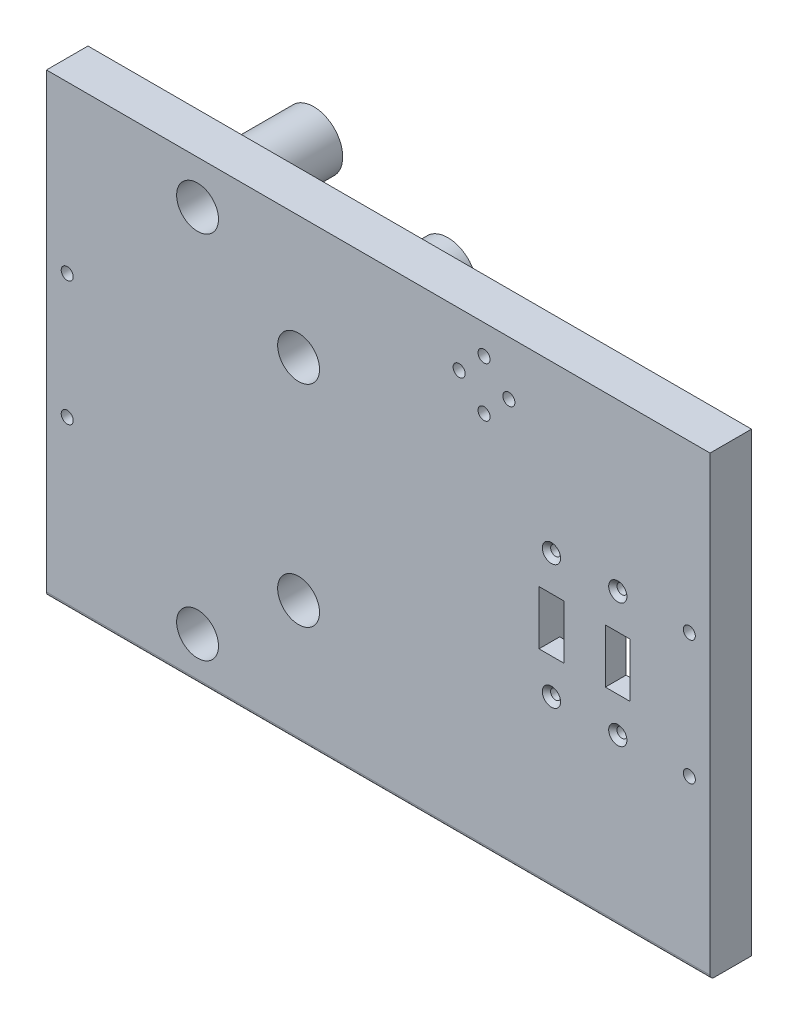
ISO-10303-21;
HEADER;
FILE_DESCRIPTION(('STEP AP214'),'2;1');
FILE_NAME('part.step','',(''),(''),'','','');
FILE_SCHEMA(('AUTOMOTIVE_DESIGN { 1 0 10303 214 1 1 1 1 }'));
ENDSEC;
DATA;
#1=APPLICATION_CONTEXT('core data for automotive mechanical design processes');
#2=APPLICATION_PROTOCOL_DEFINITION('international standard','automotive_design',2000,#1);
#3=PRODUCT_CONTEXT('',#1,'mechanical');
#4=PRODUCT('Part','Part','',(#3));
#5=PRODUCT_RELATED_PRODUCT_CATEGORY('part','',(#4));
#6=PRODUCT_DEFINITION_FORMATION('','',#4);
#7=PRODUCT_DEFINITION_CONTEXT('part definition',#1,'design');
#8=PRODUCT_DEFINITION('design','',#6,#7);
#9=PRODUCT_DEFINITION_SHAPE('','',#8);
#10=(LENGTH_UNIT() NAMED_UNIT(*) SI_UNIT(.MILLI.,.METRE.));
#11=(NAMED_UNIT(*) PLANE_ANGLE_UNIT() SI_UNIT($,.RADIAN.));
#12=(NAMED_UNIT(*) SI_UNIT($,.STERADIAN.) SOLID_ANGLE_UNIT());
#13=UNCERTAINTY_MEASURE_WITH_UNIT(LENGTH_MEASURE(1.E-05),#10,'distance_accuracy_value','');
#14=(GEOMETRIC_REPRESENTATION_CONTEXT(3) GLOBAL_UNCERTAINTY_ASSIGNED_CONTEXT((#13)) GLOBAL_UNIT_ASSIGNED_CONTEXT((#10,
#11,#12)) REPRESENTATION_CONTEXT('',''));
#15=CARTESIAN_POINT('',(0.,0.,0.));
#16=DIRECTION('',(0.,0.,1.));
#17=DIRECTION('',(1.,0.,0.));
#18=AXIS2_PLACEMENT_3D('',#15,#16,#17);
#19=CARTESIAN_POINT('',(0.,0.,0.));
#20=DIRECTION('',(0.,0.,1.));
#21=DIRECTION('',(1.,0.,0.));
#22=AXIS2_PLACEMENT_3D('',#19,#20,#21);
#23=PLANE('',#22);
#24=CARTESIAN_POINT('',(-8.47186139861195,-66.4983642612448,0.));
#25=DIRECTION('',(0.,0.,1.));
#26=DIRECTION('',(1.,0.,0.));
#27=AXIS2_PLACEMENT_3D('',#24,#25,#26);
#28=CIRCLE('',#27,7.);
#29=CARTESIAN_POINT('',(-1.47186139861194,-66.4983642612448,0.));
#30=VERTEX_POINT('',#29);
#31=EDGE_CURVE('E50',#30,#30,#28,.F.);
#32=ORIENTED_EDGE('',*,*,#31,.F.);
#33=EDGE_LOOP('',(#32));
#34=FACE_BOUND('',#33,.T.);
#35=CARTESIAN_POINT('',(-8.47186139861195,-15.7354553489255,0.));
#36=DIRECTION('',(0.,0.,1.));
#37=DIRECTION('',(1.,0.,0.));
#38=AXIS2_PLACEMENT_3D('',#35,#36,#37);
#39=CIRCLE('',#38,7.);
#40=CARTESIAN_POINT('',(-1.47186139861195,-15.7354553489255,0.));
#41=VERTEX_POINT('',#40);
#42=EDGE_CURVE('E266',#41,#41,#39,.F.);
#43=ORIENTED_EDGE('',*,*,#42,.F.);
#44=EDGE_LOOP('',(#43));
#45=FACE_BOUND('',#44,.T.);
#46=CARTESIAN_POINT('',(85.7423896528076,-26.1169098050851,0.));
#47=DIRECTION('',(0.,0.,-1.));
#48=DIRECTION('',(-1.,0.,0.));
#49=AXIS2_PLACEMENT_3D('',#46,#47,#48);
#50=CIRCLE('',#49,1.45);
#51=CARTESIAN_POINT('',(84.2923896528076,-26.1169098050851,0.));
#52=VERTEX_POINT('',#51);
#53=EDGE_CURVE('E343',#52,#52,#50,.T.);
#54=ORIENTED_EDGE('',*,*,#53,.F.);
#55=EDGE_LOOP('',(#54));
#56=FACE_BOUND('',#55,.T.);
#57=CARTESIAN_POINT('',(85.7423896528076,-56.1169098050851,0.));
#58=DIRECTION('',(0.,0.,-1.));
#59=DIRECTION('',(1.,0.,0.));
#60=AXIS2_PLACEMENT_3D('',#57,#58,#59);
#61=CIRCLE('',#60,1.45);
#62=CARTESIAN_POINT('',(87.1923896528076,-56.1169098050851,0.));
#63=VERTEX_POINT('',#62);
#64=EDGE_CURVE('E337',#63,#63,#61,.T.);
#65=ORIENTED_EDGE('',*,*,#64,.F.);
#66=EDGE_LOOP('',(#65));
#67=FACE_BOUND('',#66,.T.);
#68=CARTESIAN_POINT('',(-64.2576103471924,-56.1169098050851,0.));
#69=DIRECTION('',(0.,0.,-1.));
#70=DIRECTION('',(-1.,0.,0.));
#71=AXIS2_PLACEMENT_3D('',#68,#69,#70);
#72=CIRCLE('',#71,1.45);
#73=CARTESIAN_POINT('',(-65.7076103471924,-56.1169098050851,0.));
#74=VERTEX_POINT('',#73);
#75=EDGE_CURVE('E330',#74,#74,#72,.T.);
#76=ORIENTED_EDGE('',*,*,#75,.F.);
#77=EDGE_LOOP('',(#76));
#78=FACE_BOUND('',#77,.T.);
#79=CARTESIAN_POINT('',(-64.2576103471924,-26.1169098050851,0.));
#80=DIRECTION('',(0.,0.,-1.));
#81=DIRECTION('',(1.,0.,0.));
#82=AXIS2_PLACEMENT_3D('',#79,#80,#81);
#83=CIRCLE('',#82,1.45);
#84=CARTESIAN_POINT('',(-62.8076103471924,-26.1169098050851,0.));
#85=VERTEX_POINT('',#84);
#86=EDGE_CURVE('E333',#85,#85,#83,.T.);
#87=ORIENTED_EDGE('',*,*,#86,.F.);
#88=EDGE_LOOP('',(#87));
#89=FACE_BOUND('',#88,.T.);
#90=CARTESIAN_POINT('',(42.2423896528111,0.883090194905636,0.));
#91=DIRECTION('',(0.,0.,-1.));
#92=DIRECTION('',(-1.,0.,0.));
#93=AXIS2_PLACEMENT_3D('',#90,#91,#92);
#94=CIRCLE('',#93,2.75);
#95=CARTESIAN_POINT('',(39.4923896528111,0.883090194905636,0.));
#96=VERTEX_POINT('',#95);
#97=EDGE_CURVE('E351',#96,#96,#94,.T.);
#98=ORIENTED_EDGE('',*,*,#97,.F.);
#99=EDGE_LOOP('',(#98));
#100=FACE_BOUND('',#99,.T.);
#101=CARTESIAN_POINT('',(36.2423896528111,-5.11690980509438,0.));
#102=DIRECTION('',(0.,0.,-1.));
#103=DIRECTION('',(-1.,0.,0.));
#104=AXIS2_PLACEMENT_3D('',#101,#102,#103);
#105=CIRCLE('',#104,2.75);
#106=CARTESIAN_POINT('',(33.4923896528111,-5.11690980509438,0.));
#107=VERTEX_POINT('',#106);
#108=EDGE_CURVE('E362',#107,#107,#105,.T.);
#109=ORIENTED_EDGE('',*,*,#108,.F.);
#110=EDGE_LOOP('',(#109));
#111=FACE_BOUND('',#110,.T.);
#112=CARTESIAN_POINT('',(30.2423896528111,0.883090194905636,0.));
#113=DIRECTION('',(0.,0.,-1.));
#114=DIRECTION('',(-1.,0.,0.));
#115=AXIS2_PLACEMENT_3D('',#112,#113,#114);
#116=CIRCLE('',#115,2.75);
#117=CARTESIAN_POINT('',(27.4923896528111,0.883090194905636,0.));
#118=VERTEX_POINT('',#117);
#119=EDGE_CURVE('E371',#118,#118,#116,.T.);
#120=ORIENTED_EDGE('',*,*,#119,.F.);
#121=EDGE_LOOP('',(#120));
#122=FACE_BOUND('',#121,.T.);
#123=CARTESIAN_POINT('',(36.2423896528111,6.88309019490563,0.));
#124=DIRECTION('',(0.,0.,-1.));
#125=DIRECTION('',(-1.,0.,0.));
#126=AXIS2_PLACEMENT_3D('',#123,#124,#125);
#127=CIRCLE('',#126,2.75);
#128=CARTESIAN_POINT('',(33.4923896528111,6.88309019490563,0.));
#129=VERTEX_POINT('',#128);
#130=EDGE_CURVE('E380',#129,#129,#127,.T.);
#131=ORIENTED_EDGE('',*,*,#130,.F.);
#132=EDGE_LOOP('',(#131));
#133=FACE_BOUND('',#132,.T.);
#134=DIRECTION('',(-1.,0.,0.));
#135=VECTOR('',#134,1.);
#136=CARTESIAN_POINT('',(71.4981129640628,-58.6169098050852,0.));
#137=LINE('',#136,#135);
#138=CARTESIAN_POINT('',(71.4981129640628,-58.6169098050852,0.));
#139=VERTEX_POINT('',#138);
#140=CARTESIAN_POINT('',(49.4981129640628,-58.6169098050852,0.));
#141=VERTEX_POINT('',#140);
#142=EDGE_CURVE('E200',#139,#141,#137,.T.);
#143=ORIENTED_EDGE('',*,*,#142,.F.);
#144=DIRECTION('',(0.,-1.,0.));
#145=VECTOR('',#144,1.);
#146=CARTESIAN_POINT('',(71.4981129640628,-23.6169098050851,0.));
#147=LINE('',#146,#145);
#148=CARTESIAN_POINT('',(71.4981129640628,-23.6169098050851,0.));
#149=VERTEX_POINT('',#148);
#150=EDGE_CURVE('E198',#149,#139,#147,.T.);
#151=ORIENTED_EDGE('',*,*,#150,.F.);
#152=DIRECTION('',(1.,0.,0.));
#153=VECTOR('',#152,1.);
#154=CARTESIAN_POINT('',(71.4981129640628,-23.6169098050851,0.));
#155=LINE('',#154,#153);
#156=CARTESIAN_POINT('',(49.4981129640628,-23.6169098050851,0.));
#157=VERTEX_POINT('',#156);
#158=EDGE_CURVE('E206',#157,#149,#155,.T.);
#159=ORIENTED_EDGE('',*,*,#158,.F.);
#160=DIRECTION('',(0.,1.,0.));
#161=VECTOR('',#160,1.);
#162=CARTESIAN_POINT('',(49.4981129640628,-23.6169098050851,0.));
#163=LINE('',#162,#161);
#164=EDGE_CURVE('E204',#141,#157,#163,.T.);
#165=ORIENTED_EDGE('',*,*,#164,.F.);
#166=EDGE_LOOP('',(#143,#151,#159,#165));
#167=FACE_BOUND('',#166,.T.);
#168=DIRECTION('',(0.,-1.,0.));
#169=VECTOR('',#168,1.);
#170=CARTESIAN_POINT('',(-69.2576103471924,13.8830901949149,0.));
#171=LINE('',#170,#169);
#172=CARTESIAN_POINT('',(-69.2576103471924,13.8830901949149,0.));
#173=VERTEX_POINT('',#172);
#174=CARTESIAN_POINT('',(-69.2576103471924,-96.1169098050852,0.));
#175=VERTEX_POINT('',#174);
#176=EDGE_CURVE('E222',#173,#175,#171,.T.);
#177=ORIENTED_EDGE('',*,*,#176,.F.);
#178=DIRECTION('',(-1.,0.,0.));
#179=VECTOR('',#178,1.);
#180=CARTESIAN_POINT('',(-69.2576103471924,13.8830901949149,0.));
#181=LINE('',#180,#179);
#182=CARTESIAN_POINT('',(90.7423896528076,13.8830901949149,0.));
#183=VERTEX_POINT('',#182);
#184=EDGE_CURVE('E235',#183,#173,#181,.T.);
#185=ORIENTED_EDGE('',*,*,#184,.F.);
#186=DIRECTION('',(0.,1.,0.));
#187=VECTOR('',#186,1.);
#188=CARTESIAN_POINT('',(90.7423896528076,13.8830901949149,0.));
#189=LINE('',#188,#187);
#190=CARTESIAN_POINT('',(90.7423896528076,-96.1169098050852,0.));
#191=VERTEX_POINT('',#190);
#192=EDGE_CURVE('E245',#191,#183,#189,.T.);
#193=ORIENTED_EDGE('',*,*,#192,.F.);
#194=DIRECTION('',(1.,0.,0.));
#195=VECTOR('',#194,1.);
#196=CARTESIAN_POINT('',(-69.2576103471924,-96.1169098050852,0.));
#197=LINE('',#196,#195);
#198=EDGE_CURVE('E242',#175,#191,#197,.T.);
#199=ORIENTED_EDGE('',*,*,#198,.F.);
#200=EDGE_LOOP('',(#177,#185,#193,#199));
#201=FACE_BOUND('',#200,.T.);
#202=CARTESIAN_POINT('',(-32.8300788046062,3.43945651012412,0.));
#203=DIRECTION('',(0.,0.,1.));
#204=DIRECTION('',(1.,0.,0.));
#205=AXIS2_PLACEMENT_3D('',#202,#203,#204);
#206=CIRCLE('',#205,7.);
#207=CARTESIAN_POINT('',(-25.8300788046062,3.43945651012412,0.));
#208=VERTEX_POINT('',#207);
#209=EDGE_CURVE('E269',#208,#208,#206,.F.);
#210=ORIENTED_EDGE('',*,*,#209,.F.);
#211=EDGE_LOOP('',(#210));
#212=FACE_BOUND('',#211,.T.);
#213=CARTESIAN_POINT('',(-32.8300788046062,-85.6732761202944,0.));
#214=DIRECTION('',(0.,0.,1.));
#215=DIRECTION('',(1.,0.,0.));
#216=AXIS2_PLACEMENT_3D('',#213,#214,#215);
#217=CIRCLE('',#216,7.);
#218=CARTESIAN_POINT('',(-25.8300788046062,-85.6732761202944,0.));
#219=VERTEX_POINT('',#218);
#220=EDGE_CURVE('E11',#219,#219,#217,.F.);
#221=ORIENTED_EDGE('',*,*,#220,.F.);
#222=EDGE_LOOP('',(#221));
#223=FACE_BOUND('',#222,.T.);
#224=ADVANCED_FACE('F41',(#34,#45,#56,#67,#78,#89,#100,#111,#122,#133,#167,#201,#212,#223),#23,.F.);
#225=CARTESIAN_POINT('',(0.,0.,10.));
#226=DIRECTION('',(0.,0.,1.));
#227=DIRECTION('',(1.,0.,0.));
#228=AXIS2_PLACEMENT_3D('',#225,#226,#227);
#229=PLANE('',#228);
#230=CARTESIAN_POINT('',(52.4981129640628,-26.1169098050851,10.));
#231=DIRECTION('',(0.,0.,1.));
#232=DIRECTION('',(1.,0.,0.));
#233=AXIS2_PLACEMENT_3D('',#230,#231,#232);
#234=CIRCLE('',#233,2.2);
#235=CARTESIAN_POINT('',(54.6981129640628,-26.1169098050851,10.));
#236=VERTEX_POINT('',#235);
#237=EDGE_CURVE('E870',#236,#236,#234,.T.);
#238=ORIENTED_EDGE('',*,*,#237,.F.);
#239=EDGE_LOOP('',(#238));
#240=FACE_BOUND('',#239,.T.);
#241=CARTESIAN_POINT('',(68.4981129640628,-26.1169098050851,10.));
#242=DIRECTION('',(0.,0.,1.));
#243=DIRECTION('',(1.,0.,0.));
#244=AXIS2_PLACEMENT_3D('',#241,#242,#243);
#245=CIRCLE('',#244,2.20000000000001);
#246=CARTESIAN_POINT('',(70.6981129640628,-26.1169098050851,10.));
#247=VERTEX_POINT('',#246);
#248=EDGE_CURVE('E292',#247,#247,#245,.T.);
#249=ORIENTED_EDGE('',*,*,#248,.F.);
#250=EDGE_LOOP('',(#249));
#251=FACE_BOUND('',#250,.T.);
#252=CARTESIAN_POINT('',(52.4981129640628,-56.1169098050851,10.));
#253=DIRECTION('',(0.,0.,1.));
#254=DIRECTION('',(1.,0.,0.));
#255=AXIS2_PLACEMENT_3D('',#252,#253,#254);
#256=CIRCLE('',#255,2.2);
#257=CARTESIAN_POINT('',(54.6981129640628,-56.1169098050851,10.));
#258=VERTEX_POINT('',#257);
#259=EDGE_CURVE('E285',#258,#258,#256,.T.);
#260=ORIENTED_EDGE('',*,*,#259,.F.);
#261=EDGE_LOOP('',(#260));
#262=FACE_BOUND('',#261,.T.);
#263=CARTESIAN_POINT('',(68.4981129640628,-56.1169098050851,10.));
#264=DIRECTION('',(0.,0.,1.));
#265=DIRECTION('',(1.,0.,0.));
#266=AXIS2_PLACEMENT_3D('',#263,#264,#265);
#267=CIRCLE('',#266,2.19999999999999);
#268=CARTESIAN_POINT('',(70.6981129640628,-56.1169098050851,10.));
#269=VERTEX_POINT('',#268);
#270=EDGE_CURVE('E281',#269,#269,#267,.T.);
#271=ORIENTED_EDGE('',*,*,#270,.F.);
#272=EDGE_LOOP('',(#271));
#273=FACE_BOUND('',#272,.T.);
#274=CARTESIAN_POINT('',(85.7423896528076,-26.1169098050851,10.));
#275=DIRECTION('',(0.,0.,-1.));
#276=DIRECTION('',(-1.,0.,0.));
#277=AXIS2_PLACEMENT_3D('',#274,#275,#276);
#278=CIRCLE('',#277,1.45);
#279=CARTESIAN_POINT('',(84.2923896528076,-26.1169098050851,10.));
#280=VERTEX_POINT('',#279);
#281=EDGE_CURVE('E329',#280,#280,#278,.T.);
#282=ORIENTED_EDGE('',*,*,#281,.T.);
#283=EDGE_LOOP('',(#282));
#284=FACE_BOUND('',#283,.T.);
#285=CARTESIAN_POINT('',(85.7423896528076,-56.1169098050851,10.));
#286=DIRECTION('',(0.,0.,-1.));
#287=DIRECTION('',(1.,0.,0.));
#288=AXIS2_PLACEMENT_3D('',#285,#286,#287);
#289=CIRCLE('',#288,1.45);
#290=CARTESIAN_POINT('',(87.1923896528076,-56.1169098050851,10.));
#291=VERTEX_POINT('',#290);
#292=EDGE_CURVE('E340',#291,#291,#289,.T.);
#293=ORIENTED_EDGE('',*,*,#292,.T.);
#294=EDGE_LOOP('',(#293));
#295=FACE_BOUND('',#294,.T.);
#296=CARTESIAN_POINT('',(-64.2576103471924,-56.1169098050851,10.));
#297=DIRECTION('',(0.,0.,-1.));
#298=DIRECTION('',(-1.,0.,0.));
#299=AXIS2_PLACEMENT_3D('',#296,#297,#298);
#300=CIRCLE('',#299,1.45);
#301=CARTESIAN_POINT('',(-65.7076103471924,-56.1169098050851,10.));
#302=VERTEX_POINT('',#301);
#303=EDGE_CURVE('E334',#302,#302,#300,.T.);
#304=ORIENTED_EDGE('',*,*,#303,.T.);
#305=EDGE_LOOP('',(#304));
#306=FACE_BOUND('',#305,.T.);
#307=CARTESIAN_POINT('',(-64.2576103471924,-26.1169098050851,10.));
#308=DIRECTION('',(0.,0.,-1.));
#309=DIRECTION('',(1.,0.,0.));
#310=AXIS2_PLACEMENT_3D('',#307,#308,#309);
#311=CIRCLE('',#310,1.45);
#312=CARTESIAN_POINT('',(-62.8076103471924,-26.1169098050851,10.));
#313=VERTEX_POINT('',#312);
#314=EDGE_CURVE('E348',#313,#313,#311,.T.);
#315=ORIENTED_EDGE('',*,*,#314,.T.);
#316=EDGE_LOOP('',(#315));
#317=FACE_BOUND('',#316,.T.);
#318=CARTESIAN_POINT('',(42.2423896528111,0.883090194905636,10.));
#319=DIRECTION('',(0.,0.,-1.));
#320=DIRECTION('',(-1.,0.,0.));
#321=AXIS2_PLACEMENT_3D('',#318,#319,#320);
#322=CIRCLE('',#321,1.45);
#323=CARTESIAN_POINT('',(40.7923896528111,0.883090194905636,10.));
#324=VERTEX_POINT('',#323);
#325=EDGE_CURVE('E359',#324,#324,#322,.T.);
#326=ORIENTED_EDGE('',*,*,#325,.T.);
#327=EDGE_LOOP('',(#326));
#328=FACE_BOUND('',#327,.T.);
#329=CARTESIAN_POINT('',(36.2423896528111,6.88309019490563,10.));
#330=DIRECTION('',(0.,0.,-1.));
#331=DIRECTION('',(-1.,0.,0.));
#332=AXIS2_PLACEMENT_3D('',#329,#330,#331);
#333=CIRCLE('',#332,1.45);
#334=CARTESIAN_POINT('',(34.7923896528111,6.88309019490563,10.));
#335=VERTEX_POINT('',#334);
#336=EDGE_CURVE('E175',#335,#335,#333,.T.);
#337=ORIENTED_EDGE('',*,*,#336,.T.);
#338=EDGE_LOOP('',(#337));
#339=FACE_BOUND('',#338,.T.);
#340=DIRECTION('',(0.,1.,0.));
#341=VECTOR('',#340,1.);
#342=CARTESIAN_POINT('',(49.4981129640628,-34.6169098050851,10.));
#343=LINE('',#342,#341);
#344=CARTESIAN_POINT('',(49.4981129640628,-47.6169098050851,10.));
#345=VERTEX_POINT('',#344);
#346=CARTESIAN_POINT('',(49.4981129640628,-34.6169098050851,10.));
#347=VERTEX_POINT('',#346);
#348=EDGE_CURVE('E170',#345,#347,#343,.T.);
#349=ORIENTED_EDGE('',*,*,#348,.T.);
#350=DIRECTION('',(1.,0.,0.));
#351=VECTOR('',#350,1.);
#352=CARTESIAN_POINT('',(49.4981129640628,-34.6169098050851,10.));
#353=LINE('',#352,#351);
#354=CARTESIAN_POINT('',(55.4981129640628,-34.6169098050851,10.));
#355=VERTEX_POINT('',#354);
#356=EDGE_CURVE('E401',#347,#355,#353,.T.);
#357=ORIENTED_EDGE('',*,*,#356,.T.);
#358=DIRECTION('',(0.,-1.,0.));
#359=VECTOR('',#358,1.);
#360=CARTESIAN_POINT('',(55.4981129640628,-34.6169098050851,10.));
#361=LINE('',#360,#359);
#362=CARTESIAN_POINT('',(55.4981129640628,-47.6169098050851,10.));
#363=VERTEX_POINT('',#362);
#364=EDGE_CURVE('E58',#355,#363,#361,.T.);
#365=ORIENTED_EDGE('',*,*,#364,.T.);
#366=DIRECTION('',(-1.,0.,0.));
#367=VECTOR('',#366,1.);
#368=CARTESIAN_POINT('',(49.4981129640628,-47.6169098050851,10.));
#369=LINE('',#368,#367);
#370=EDGE_CURVE('E390',#363,#345,#369,.T.);
#371=ORIENTED_EDGE('',*,*,#370,.T.);
#372=EDGE_LOOP('',(#349,#357,#365,#371));
#373=FACE_BOUND('',#372,.T.);
#374=DIRECTION('',(1.,0.,0.));
#375=VECTOR('',#374,1.);
#376=CARTESIAN_POINT('',(71.4981129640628,-34.6169098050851,10.));
#377=LINE('',#376,#375);
#378=CARTESIAN_POINT('',(65.4981129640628,-34.6169098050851,10.));
#379=VERTEX_POINT('',#378);
#380=CARTESIAN_POINT('',(71.4981129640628,-34.6169098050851,10.));
#381=VERTEX_POINT('',#380);
#382=EDGE_CURVE('E405',#379,#381,#377,.T.);
#383=ORIENTED_EDGE('',*,*,#382,.T.);
#384=DIRECTION('',(0.,-1.,0.));
#385=VECTOR('',#384,1.);
#386=CARTESIAN_POINT('',(71.4981129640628,-34.6169098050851,10.));
#387=LINE('',#386,#385);
#388=CARTESIAN_POINT('',(71.4981129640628,-47.6169098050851,10.));
#389=VERTEX_POINT('',#388);
#390=EDGE_CURVE('E408',#381,#389,#387,.T.);
#391=ORIENTED_EDGE('',*,*,#390,.T.);
#392=DIRECTION('',(-1.,0.,0.));
#393=VECTOR('',#392,1.);
#394=CARTESIAN_POINT('',(71.4981129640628,-47.6169098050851,10.));
#395=LINE('',#394,#393);
#396=CARTESIAN_POINT('',(65.4981129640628,-47.6169098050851,10.));
#397=VERTEX_POINT('',#396);
#398=EDGE_CURVE('E66',#389,#397,#395,.T.);
#399=ORIENTED_EDGE('',*,*,#398,.T.);
#400=DIRECTION('',(0.,1.,0.));
#401=VECTOR('',#400,1.);
#402=CARTESIAN_POINT('',(65.4981129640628,-34.6169098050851,10.));
#403=LINE('',#402,#401);
#404=EDGE_CURVE('E413',#397,#379,#403,.T.);
#405=ORIENTED_EDGE('',*,*,#404,.T.);
#406=EDGE_LOOP('',(#383,#391,#399,#405));
#407=FACE_BOUND('',#406,.T.);
#408=CARTESIAN_POINT('',(-32.8300788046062,3.43945651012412,10.));
#409=DIRECTION('',(0.,0.,1.));
#410=DIRECTION('',(1.,0.,0.));
#411=AXIS2_PLACEMENT_3D('',#408,#409,#410);
#412=CIRCLE('',#411,5.05);
#413=CARTESIAN_POINT('',(-27.7800788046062,3.43945651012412,10.));
#414=VERTEX_POINT('',#413);
#415=EDGE_CURVE('E219',#414,#414,#412,.T.);
#416=ORIENTED_EDGE('',*,*,#415,.F.);
#417=EDGE_LOOP('',(#416));
#418=FACE_BOUND('',#417,.T.);
#419=CARTESIAN_POINT('',(-32.8300788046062,-85.6732761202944,10.));
#420=DIRECTION('',(0.,0.,1.));
#421=DIRECTION('',(-1.,0.,0.));
#422=AXIS2_PLACEMENT_3D('',#419,#420,#421);
#423=CIRCLE('',#422,5.05);
#424=CARTESIAN_POINT('',(-37.8800788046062,-85.6732761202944,10.));
#425=VERTEX_POINT('',#424);
#426=EDGE_CURVE('E223',#425,#425,#423,.T.);
#427=ORIENTED_EDGE('',*,*,#426,.F.);
#428=EDGE_LOOP('',(#427));
#429=FACE_BOUND('',#428,.T.);
#430=CARTESIAN_POINT('',(-8.47186139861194,-66.4983642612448,10.));
#431=DIRECTION('',(0.,0.,1.));
#432=DIRECTION('',(-1.,0.,0.));
#433=AXIS2_PLACEMENT_3D('',#430,#431,#432);
#434=CIRCLE('',#433,5.05);
#435=CARTESIAN_POINT('',(-13.5218613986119,-66.4983642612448,10.));
#436=VERTEX_POINT('',#435);
#437=EDGE_CURVE('E226',#436,#436,#434,.T.);
#438=ORIENTED_EDGE('',*,*,#437,.F.);
#439=EDGE_LOOP('',(#438));
#440=FACE_BOUND('',#439,.T.);
#441=CARTESIAN_POINT('',(-8.47186139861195,-15.7354553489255,10.));
#442=DIRECTION('',(0.,0.,1.));
#443=DIRECTION('',(1.,0.,0.));
#444=AXIS2_PLACEMENT_3D('',#441,#442,#443);
#445=CIRCLE('',#444,5.05);
#446=CARTESIAN_POINT('',(-3.42186139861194,-15.7354553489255,10.));
#447=VERTEX_POINT('',#446);
#448=EDGE_CURVE('E212',#447,#447,#445,.T.);
#449=ORIENTED_EDGE('',*,*,#448,.F.);
#450=EDGE_LOOP('',(#449));
#451=FACE_BOUND('',#450,.T.);
#452=DIRECTION('',(0.,-1.,0.));
#453=VECTOR('',#452,1.);
#454=CARTESIAN_POINT('',(-69.2576103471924,13.8830901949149,10.));
#455=LINE('',#454,#453);
#456=CARTESIAN_POINT('',(-69.2576103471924,13.8830901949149,10.));
#457=VERTEX_POINT('',#456);
#458=CARTESIAN_POINT('',(-69.2576103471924,-95.1169098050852,10.));
#459=VERTEX_POINT('',#458);
#460=EDGE_CURVE('E231',#457,#459,#455,.T.);
#461=ORIENTED_EDGE('',*,*,#460,.T.);
#462=DIRECTION('',(1.,0.,0.));
#463=VECTOR('',#462,1.);
#464=CARTESIAN_POINT('',(90.7423896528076,-95.1169098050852,10.));
#465=LINE('',#464,#463);
#466=CARTESIAN_POINT('',(90.7423896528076,-95.1169098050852,10.));
#467=VERTEX_POINT('',#466);
#468=EDGE_CURVE('E257',#459,#467,#465,.T.);
#469=ORIENTED_EDGE('',*,*,#468,.T.);
#470=DIRECTION('',(0.,1.,0.));
#471=VECTOR('',#470,1.);
#472=CARTESIAN_POINT('',(90.7423896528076,13.8830901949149,10.));
#473=LINE('',#472,#471);
#474=CARTESIAN_POINT('',(90.7423896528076,13.8830901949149,10.));
#475=VERTEX_POINT('',#474);
#476=EDGE_CURVE('E234',#467,#475,#473,.T.);
#477=ORIENTED_EDGE('',*,*,#476,.T.);
#478=DIRECTION('',(-1.,0.,0.));
#479=VECTOR('',#478,1.);
#480=CARTESIAN_POINT('',(-69.2576103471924,13.8830901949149,10.));
#481=LINE('',#480,#479);
#482=EDGE_CURVE('E237',#475,#457,#481,.T.);
#483=ORIENTED_EDGE('',*,*,#482,.T.);
#484=EDGE_LOOP('',(#461,#469,#477,#483));
#485=FACE_BOUND('',#484,.T.);
#486=CARTESIAN_POINT('',(30.2423896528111,0.883090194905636,10.));
#487=DIRECTION('',(0.,0.,-1.));
#488=DIRECTION('',(-1.,0.,0.));
#489=AXIS2_PLACEMENT_3D('',#486,#487,#488);
#490=CIRCLE('',#489,1.45);
#491=CARTESIAN_POINT('',(28.7923896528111,0.883090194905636,10.));
#492=VERTEX_POINT('',#491);
#493=EDGE_CURVE('E377',#492,#492,#490,.T.);
#494=ORIENTED_EDGE('',*,*,#493,.T.);
#495=EDGE_LOOP('',(#494));
#496=FACE_BOUND('',#495,.T.);
#497=CARTESIAN_POINT('',(36.2423896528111,-5.11690980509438,10.));
#498=DIRECTION('',(0.,0.,-1.));
#499=DIRECTION('',(-1.,0.,0.));
#500=AXIS2_PLACEMENT_3D('',#497,#498,#499);
#501=CIRCLE('',#500,1.45);
#502=CARTESIAN_POINT('',(34.7923896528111,-5.11690980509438,10.));
#503=VERTEX_POINT('',#502);
#504=EDGE_CURVE('E368',#503,#503,#501,.T.);
#505=ORIENTED_EDGE('',*,*,#504,.T.);
#506=EDGE_LOOP('',(#505));
#507=FACE_BOUND('',#506,.T.);
#508=ADVANCED_FACE('F456',(#240,#251,#262,#273,#284,#295,#306,#317,#328,#339,#373,#407,#418,
#429,#440,#451,#485,#496,#507),#229,.T.);
#509=CARTESIAN_POINT('',(-69.2576103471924,13.8830901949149,10.));
#510=DIRECTION('',(1.,0.,0.));
#511=DIRECTION('',(0.,1.,0.));
#512=AXIS2_PLACEMENT_3D('',#509,#510,#511);
#513=PLANE('',#512);
#514=DIRECTION('',(0.,0.,-1.));
#515=VECTOR('',#514,1.);
#516=CARTESIAN_POINT('',(-69.2576103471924,-96.1169098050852,10.));
#517=LINE('',#516,#515);
#518=CARTESIAN_POINT('',(-69.2576103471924,-96.1169098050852,9.));
#519=VERTEX_POINT('',#518);
#520=EDGE_CURVE('E255',#519,#175,#517,.T.);
#521=ORIENTED_EDGE('',*,*,#520,.F.);
#522=CARTESIAN_POINT('',(-69.2576103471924,-95.1169098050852,9.));
#523=DIRECTION('',(1.,0.,0.));
#524=DIRECTION('',(0.,1.,0.));
#525=AXIS2_PLACEMENT_3D('',#522,#523,#524);
#526=CIRCLE('',#525,1.);
#527=EDGE_CURVE('E264',#519,#459,#526,.F.);
#528=ORIENTED_EDGE('',*,*,#527,.T.);
#529=ORIENTED_EDGE('',*,*,#460,.F.);
#530=DIRECTION('',(0.,0.,-1.));
#531=VECTOR('',#530,1.);
#532=CARTESIAN_POINT('',(-69.2576103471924,13.8830901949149,10.));
#533=LINE('',#532,#531);
#534=EDGE_CURVE('E239',#457,#173,#533,.T.);
#535=ORIENTED_EDGE('',*,*,#534,.T.);
#536=ORIENTED_EDGE('',*,*,#176,.T.);
#537=EDGE_LOOP('',(#521,#528,#529,#535,#536));
#538=FACE_BOUND('',#537,.T.);
#539=ADVANCED_FACE('F459',(#538),#513,.F.);
#540=CARTESIAN_POINT('',(-69.2576103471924,-96.1169098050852,10.));
#541=DIRECTION('',(0.,1.,0.));
#542=DIRECTION('',(0.,0.,1.));
#543=AXIS2_PLACEMENT_3D('',#540,#541,#542);
#544=PLANE('',#543);
#545=DIRECTION('',(0.,0.,-1.));
#546=VECTOR('',#545,1.);
#547=CARTESIAN_POINT('',(90.7423896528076,-96.1169098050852,10.));
#548=LINE('',#547,#546);
#549=CARTESIAN_POINT('',(90.7423896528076,-96.1169098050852,9.));
#550=VERTEX_POINT('',#549);
#551=EDGE_CURVE('E253',#550,#191,#548,.T.);
#552=ORIENTED_EDGE('',*,*,#551,.F.);
#553=DIRECTION('',(1.,0.,0.));
#554=VECTOR('',#553,1.);
#555=CARTESIAN_POINT('',(-69.2576103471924,-96.1169098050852,9.));
#556=LINE('',#555,#554);
#557=EDGE_CURVE('E262',#550,#519,#556,.F.);
#558=ORIENTED_EDGE('',*,*,#557,.T.);
#559=ORIENTED_EDGE('',*,*,#520,.T.);
#560=ORIENTED_EDGE('',*,*,#198,.T.);
#561=EDGE_LOOP('',(#552,#558,#559,#560));
#562=FACE_BOUND('',#561,.T.);
#563=ADVANCED_FACE('F570',(#562),#544,.F.);
#564=CARTESIAN_POINT('',(90.7423896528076,13.8830901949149,10.));
#565=DIRECTION('',(-1.,0.,0.));
#566=DIRECTION('',(0.,0.,1.));
#567=AXIS2_PLACEMENT_3D('',#564,#565,#566);
#568=PLANE('',#567);
#569=ORIENTED_EDGE('',*,*,#476,.F.);
#570=CARTESIAN_POINT('',(90.7423896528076,-95.1169098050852,9.));
#571=DIRECTION('',(-1.,0.,0.));
#572=DIRECTION('',(0.,0.,1.));
#573=AXIS2_PLACEMENT_3D('',#570,#571,#572);
#574=CIRCLE('',#573,1.);
#575=EDGE_CURVE('E260',#467,#550,#574,.F.);
#576=ORIENTED_EDGE('',*,*,#575,.T.);
#577=ORIENTED_EDGE('',*,*,#551,.T.);
#578=ORIENTED_EDGE('',*,*,#192,.T.);
#579=DIRECTION('',(0.,0.,-1.));
#580=VECTOR('',#579,1.);
#581=CARTESIAN_POINT('',(90.7423896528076,13.8830901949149,10.));
#582=LINE('',#581,#580);
#583=EDGE_CURVE('E250',#475,#183,#582,.T.);
#584=ORIENTED_EDGE('',*,*,#583,.F.);
#585=EDGE_LOOP('',(#569,#576,#577,#578,#584));
#586=FACE_BOUND('',#585,.T.);
#587=ADVANCED_FACE('F566',(#586),#568,.F.);
#588=CARTESIAN_POINT('',(-69.2576103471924,13.8830901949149,10.));
#589=DIRECTION('',(0.,-1.,0.));
#590=DIRECTION('',(0.,0.,-1.));
#591=AXIS2_PLACEMENT_3D('',#588,#589,#590);
#592=PLANE('',#591);
#593=ORIENTED_EDGE('',*,*,#184,.T.);
#594=ORIENTED_EDGE('',*,*,#534,.F.);
#595=ORIENTED_EDGE('',*,*,#482,.F.);
#596=ORIENTED_EDGE('',*,*,#583,.T.);
#597=EDGE_LOOP('',(#593,#594,#595,#596));
#598=FACE_BOUND('',#597,.T.);
#599=ADVANCED_FACE('F561',(#598),#592,.F.);
#600=CARTESIAN_POINT('',(-8.47186139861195,-15.7354553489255,0.));
#601=DIRECTION('',(0.,0.,1.));
#602=DIRECTION('',(1.,0.,0.));
#603=AXIS2_PLACEMENT_3D('',#600,#601,#602);
#604=CYLINDRICAL_SURFACE('',#603,5.05);
#605=ORIENTED_EDGE('',*,*,#448,.T.);
#606=EDGE_LOOP('',(#605));
#607=FACE_BOUND('',#606,.T.);
#608=CARTESIAN_POINT('',(-8.47186139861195,-15.7354553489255,-26.));
#609=DIRECTION('',(0.,0.,-1.));
#610=DIRECTION('',(-1.,0.,0.));
#611=AXIS2_PLACEMENT_3D('',#608,#609,#610);
#612=CIRCLE('',#611,5.05000000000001);
#613=CARTESIAN_POINT('',(-13.521861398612,-15.7354553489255,-26.));
#614=VERTEX_POINT('',#613);
#615=EDGE_CURVE('E311',#614,#614,#612,.T.);
#616=ORIENTED_EDGE('',*,*,#615,.T.);
#617=EDGE_LOOP('',(#616));
#618=FACE_BOUND('',#617,.T.);
#619=ADVANCED_FACE('F558',(#607,#618),#604,.F.);
#620=CARTESIAN_POINT('',(-8.47186139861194,-66.4983642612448,0.));
#621=DIRECTION('',(0.,0.,1.));
#622=DIRECTION('',(1.,0.,0.));
#623=AXIS2_PLACEMENT_3D('',#620,#621,#622);
#624=CYLINDRICAL_SURFACE('',#623,5.05);
#625=ORIENTED_EDGE('',*,*,#437,.T.);
#626=EDGE_LOOP('',(#625));
#627=FACE_BOUND('',#626,.T.);
#628=CARTESIAN_POINT('',(-8.47186139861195,-66.4983642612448,-26.));
#629=DIRECTION('',(0.,0.,-1.));
#630=DIRECTION('',(1.,0.,0.));
#631=AXIS2_PLACEMENT_3D('',#628,#629,#630);
#632=CIRCLE('',#631,5.05);
#633=CARTESIAN_POINT('',(-3.42186139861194,-66.4983642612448,-26.));
#634=VERTEX_POINT('',#633);
#635=EDGE_CURVE('E308',#634,#634,#632,.T.);
#636=ORIENTED_EDGE('',*,*,#635,.T.);
#637=EDGE_LOOP('',(#636));
#638=FACE_BOUND('',#637,.T.);
#639=ADVANCED_FACE('F554',(#627,#638),#624,.F.);
#640=CARTESIAN_POINT('',(-32.8300788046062,-85.6732761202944,0.));
#641=DIRECTION('',(0.,0.,1.));
#642=DIRECTION('',(1.,0.,0.));
#643=AXIS2_PLACEMENT_3D('',#640,#641,#642);
#644=CYLINDRICAL_SURFACE('',#643,5.05);
#645=ORIENTED_EDGE('',*,*,#426,.T.);
#646=EDGE_LOOP('',(#645));
#647=FACE_BOUND('',#646,.T.);
#648=CARTESIAN_POINT('',(-32.8300788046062,-85.6732761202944,-18.));
#649=DIRECTION('',(0.,0.,-1.));
#650=DIRECTION('',(1.,0.,0.));
#651=AXIS2_PLACEMENT_3D('',#648,#649,#650);
#652=CIRCLE('',#651,5.05);
#653=CARTESIAN_POINT('',(-27.7800788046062,-85.6732761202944,-18.));
#654=VERTEX_POINT('',#653);
#655=EDGE_CURVE('E320',#654,#654,#652,.T.);
#656=ORIENTED_EDGE('',*,*,#655,.T.);
#657=EDGE_LOOP('',(#656));
#658=FACE_BOUND('',#657,.T.);
#659=ADVANCED_FACE('F550',(#647,#658),#644,.F.);
#660=CARTESIAN_POINT('',(-32.8300788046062,3.43945651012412,0.));
#661=DIRECTION('',(0.,0.,1.));
#662=DIRECTION('',(1.,0.,0.));
#663=AXIS2_PLACEMENT_3D('',#660,#661,#662);
#664=CYLINDRICAL_SURFACE('',#663,5.05);
#665=ORIENTED_EDGE('',*,*,#415,.T.);
#666=EDGE_LOOP('',(#665));
#667=FACE_BOUND('',#666,.T.);
#668=CARTESIAN_POINT('',(-32.8300788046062,3.43945651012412,-18.));
#669=DIRECTION('',(0.,0.,-1.));
#670=DIRECTION('',(-1.,0.,0.));
#671=AXIS2_PLACEMENT_3D('',#668,#669,#670);
#672=CIRCLE('',#671,5.05);
#673=CARTESIAN_POINT('',(-37.8800788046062,3.43945651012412,-18.));
#674=VERTEX_POINT('',#673);
#675=EDGE_CURVE('E326',#674,#674,#672,.T.);
#676=ORIENTED_EDGE('',*,*,#675,.T.);
#677=EDGE_LOOP('',(#676));
#678=FACE_BOUND('',#677,.T.);
#679=ADVANCED_FACE('F547',(#667,#678),#664,.F.);
#680=CARTESIAN_POINT('',(0.,-95.1169098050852,9.));
#681=DIRECTION('',(-1.,0.,0.));
#682=DIRECTION('',(0.,0.,1.));
#683=AXIS2_PLACEMENT_3D('',#680,#681,#682);
#684=CYLINDRICAL_SURFACE('',#683,1.);
#685=ORIENTED_EDGE('',*,*,#527,.F.);
#686=ORIENTED_EDGE('',*,*,#557,.F.);
#687=ORIENTED_EDGE('',*,*,#575,.F.);
#688=ORIENTED_EDGE('',*,*,#468,.F.);
#689=EDGE_LOOP('',(#685,#686,#687,#688));
#690=FACE_BOUND('',#689,.T.);
#691=ADVANCED_FACE('F43',(#690),#684,.T.);
#692=CARTESIAN_POINT('',(71.4981129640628,-23.6169098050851,5.));
#693=DIRECTION('',(1.,0.,0.));
#694=DIRECTION('',(0.,1.,0.));
#695=AXIS2_PLACEMENT_3D('',#692,#693,#694);
#696=PLANE('',#695);
#697=ORIENTED_EDGE('',*,*,#150,.T.);
#698=DIRECTION('',(0.,0.,-1.));
#699=VECTOR('',#698,1.);
#700=CARTESIAN_POINT('',(71.4981129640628,-58.6169098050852,5.));
#701=LINE('',#700,#699);
#702=CARTESIAN_POINT('',(71.4981129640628,-58.6169098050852,5.));
#703=VERTEX_POINT('',#702);
#704=EDGE_CURVE('E193',#703,#139,#701,.T.);
#705=ORIENTED_EDGE('',*,*,#704,.F.);
#706=DIRECTION('',(0.,-1.,0.));
#707=VECTOR('',#706,1.);
#708=CARTESIAN_POINT('',(71.4981129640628,-23.6169098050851,5.));
#709=LINE('',#708,#707);
#710=CARTESIAN_POINT('',(71.4981129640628,-47.6169098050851,5.));
#711=VERTEX_POINT('',#710);
#712=EDGE_CURVE('E209',#711,#703,#709,.T.);
#713=ORIENTED_EDGE('',*,*,#712,.F.);
#714=DIRECTION('',(0.,0.,-1.));
#715=VECTOR('',#714,1.);
#716=CARTESIAN_POINT('',(71.4981129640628,-47.6169098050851,10.));
#717=LINE('',#716,#715);
#718=EDGE_CURVE('E427',#389,#711,#717,.T.);
#719=ORIENTED_EDGE('',*,*,#718,.F.);
#720=ORIENTED_EDGE('',*,*,#390,.F.);
#721=DIRECTION('',(0.,0.,-1.));
#722=VECTOR('',#721,1.);
#723=CARTESIAN_POINT('',(71.4981129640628,-34.6169098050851,10.));
#724=LINE('',#723,#722);
#725=CARTESIAN_POINT('',(71.4981129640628,-34.6169098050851,5.));
#726=VERTEX_POINT('',#725);
#727=EDGE_CURVE('E416',#381,#726,#724,.T.);
#728=ORIENTED_EDGE('',*,*,#727,.T.);
#729=CARTESIAN_POINT('',(71.4981129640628,-23.6169098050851,5.));
#730=VERTEX_POINT('',#729);
#731=EDGE_CURVE('E429',#730,#726,#709,.T.);
#732=ORIENTED_EDGE('',*,*,#731,.F.);
#733=DIRECTION('',(0.,0.,-1.));
#734=VECTOR('',#733,1.);
#735=CARTESIAN_POINT('',(71.4981129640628,-23.6169098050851,5.));
#736=LINE('',#735,#734);
#737=EDGE_CURVE('E210',#730,#149,#736,.T.);
#738=ORIENTED_EDGE('',*,*,#737,.T.);
#739=EDGE_LOOP('',(#697,#705,#713,#719,#720,#728,#732,#738));
#740=FACE_BOUND('',#739,.T.);
#741=ADVANCED_FACE('F438',(#740),#696,.F.);
#742=CARTESIAN_POINT('',(71.4981129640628,-23.6169098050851,5.));
#743=DIRECTION('',(0.,1.,0.));
#744=DIRECTION('',(0.,0.,1.));
#745=AXIS2_PLACEMENT_3D('',#742,#743,#744);
#746=PLANE('',#745);
#747=ORIENTED_EDGE('',*,*,#158,.T.);
#748=ORIENTED_EDGE('',*,*,#737,.F.);
#749=DIRECTION('',(1.,0.,0.));
#750=VECTOR('',#749,1.);
#751=CARTESIAN_POINT('',(71.4981129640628,-23.6169098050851,5.));
#752=LINE('',#751,#750);
#753=CARTESIAN_POINT('',(49.4981129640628,-23.6169098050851,5.));
#754=VERTEX_POINT('',#753);
#755=EDGE_CURVE('E189',#754,#730,#752,.T.);
#756=ORIENTED_EDGE('',*,*,#755,.F.);
#757=DIRECTION('',(0.,0.,-1.));
#758=VECTOR('',#757,1.);
#759=CARTESIAN_POINT('',(49.4981129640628,-23.6169098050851,5.));
#760=LINE('',#759,#758);
#761=EDGE_CURVE('E213',#754,#157,#760,.T.);
#762=ORIENTED_EDGE('',*,*,#761,.T.);
#763=EDGE_LOOP('',(#747,#748,#756,#762));
#764=FACE_BOUND('',#763,.T.);
#765=ADVANCED_FACE('F451',(#764),#746,.F.);
#766=CARTESIAN_POINT('',(49.4981129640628,-23.6169098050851,5.));
#767=DIRECTION('',(-1.,0.,0.));
#768=DIRECTION('',(0.,0.,1.));
#769=AXIS2_PLACEMENT_3D('',#766,#767,#768);
#770=PLANE('',#769);
#771=ORIENTED_EDGE('',*,*,#164,.T.);
#772=ORIENTED_EDGE('',*,*,#761,.F.);
#773=DIRECTION('',(0.,1.,0.));
#774=VECTOR('',#773,1.);
#775=CARTESIAN_POINT('',(49.4981129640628,-23.6169098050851,5.));
#776=LINE('',#775,#774);
#777=CARTESIAN_POINT('',(49.4981129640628,-34.6169098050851,5.));
#778=VERTEX_POINT('',#777);
#779=EDGE_CURVE('E190',#778,#754,#776,.T.);
#780=ORIENTED_EDGE('',*,*,#779,.F.);
#781=DIRECTION('',(0.,0.,-1.));
#782=VECTOR('',#781,1.);
#783=CARTESIAN_POINT('',(49.4981129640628,-34.6169098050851,10.));
#784=LINE('',#783,#782);
#785=EDGE_CURVE('E388',#347,#778,#784,.T.);
#786=ORIENTED_EDGE('',*,*,#785,.F.);
#787=ORIENTED_EDGE('',*,*,#348,.F.);
#788=DIRECTION('',(0.,0.,-1.));
#789=VECTOR('',#788,1.);
#790=CARTESIAN_POINT('',(49.4981129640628,-47.6169098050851,10.));
#791=LINE('',#790,#789);
#792=CARTESIAN_POINT('',(49.4981129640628,-47.6169098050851,5.));
#793=VERTEX_POINT('',#792);
#794=EDGE_CURVE('E162',#345,#793,#791,.T.);
#795=ORIENTED_EDGE('',*,*,#794,.T.);
#796=CARTESIAN_POINT('',(49.4981129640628,-58.6169098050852,5.));
#797=VERTEX_POINT('',#796);
#798=EDGE_CURVE('E167',#797,#793,#776,.T.);
#799=ORIENTED_EDGE('',*,*,#798,.F.);
#800=DIRECTION('',(0.,0.,-1.));
#801=VECTOR('',#800,1.);
#802=CARTESIAN_POINT('',(49.4981129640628,-58.6169098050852,5.));
#803=LINE('',#802,#801);
#804=EDGE_CURVE('E215',#797,#141,#803,.T.);
#805=ORIENTED_EDGE('',*,*,#804,.T.);
#806=EDGE_LOOP('',(#771,#772,#780,#786,#787,#795,#799,#805));
#807=FACE_BOUND('',#806,.T.);
#808=ADVANCED_FACE('F165',(#807),#770,.F.);
#809=CARTESIAN_POINT('',(71.4981129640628,-58.6169098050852,5.));
#810=DIRECTION('',(0.,-1.,0.));
#811=DIRECTION('',(0.,0.,-1.));
#812=AXIS2_PLACEMENT_3D('',#809,#810,#811);
#813=PLANE('',#812);
#814=ORIENTED_EDGE('',*,*,#142,.T.);
#815=ORIENTED_EDGE('',*,*,#804,.F.);
#816=DIRECTION('',(-1.,0.,0.));
#817=VECTOR('',#816,1.);
#818=CARTESIAN_POINT('',(71.4981129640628,-58.6169098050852,5.));
#819=LINE('',#818,#817);
#820=EDGE_CURVE('E188',#703,#797,#819,.T.);
#821=ORIENTED_EDGE('',*,*,#820,.F.);
#822=ORIENTED_EDGE('',*,*,#704,.T.);
#823=EDGE_LOOP('',(#814,#815,#821,#822));
#824=FACE_BOUND('',#823,.T.);
#825=ADVANCED_FACE('F442',(#824),#813,.F.);
#826=CARTESIAN_POINT('',(0.,0.,5.));
#827=DIRECTION('',(0.,0.,-1.));
#828=DIRECTION('',(-1.,0.,0.));
#829=AXIS2_PLACEMENT_3D('',#826,#827,#828);
#830=PLANE('',#829);
#831=CARTESIAN_POINT('',(52.4981129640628,-26.1169098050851,5.));
#832=DIRECTION('',(0.,0.,-1.));
#833=DIRECTION('',(-1.,0.,0.));
#834=AXIS2_PLACEMENT_3D('',#831,#832,#833);
#835=CIRCLE('',#834,1.19999999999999);
#836=CARTESIAN_POINT('',(51.2981129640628,-26.1169098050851,5.));
#837=VERTEX_POINT('',#836);
#838=EDGE_CURVE('E45',#837,#837,#835,.T.);
#839=ORIENTED_EDGE('',*,*,#838,.F.);
#840=EDGE_LOOP('',(#839));
#841=FACE_BOUND('',#840,.T.);
#842=CARTESIAN_POINT('',(68.4981129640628,-26.1169098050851,5.));
#843=DIRECTION('',(0.,0.,-1.));
#844=DIRECTION('',(-1.,0.,0.));
#845=AXIS2_PLACEMENT_3D('',#842,#843,#844);
#846=CIRCLE('',#845,1.19999999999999);
#847=CARTESIAN_POINT('',(67.2981129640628,-26.1169098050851,5.));
#848=VERTEX_POINT('',#847);
#849=EDGE_CURVE('E283',#848,#848,#846,.T.);
#850=ORIENTED_EDGE('',*,*,#849,.F.);
#851=EDGE_LOOP('',(#850));
#852=FACE_BOUND('',#851,.T.);
#853=CARTESIAN_POINT('',(52.4981129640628,-56.1169098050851,5.));
#854=DIRECTION('',(0.,0.,-1.));
#855=DIRECTION('',(-1.,0.,0.));
#856=AXIS2_PLACEMENT_3D('',#853,#854,#855);
#857=CIRCLE('',#856,1.19999999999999);
#858=CARTESIAN_POINT('',(51.2981129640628,-56.1169098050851,5.));
#859=VERTEX_POINT('',#858);
#860=EDGE_CURVE('E279',#859,#859,#857,.T.);
#861=ORIENTED_EDGE('',*,*,#860,.F.);
#862=EDGE_LOOP('',(#861));
#863=FACE_BOUND('',#862,.T.);
#864=CARTESIAN_POINT('',(68.4981129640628,-56.1169098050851,5.));
#865=DIRECTION('',(0.,0.,-1.));
#866=DIRECTION('',(-1.,0.,0.));
#867=AXIS2_PLACEMENT_3D('',#864,#865,#866);
#868=CIRCLE('',#867,1.19999999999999);
#869=CARTESIAN_POINT('',(67.2981129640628,-56.1169098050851,5.));
#870=VERTEX_POINT('',#869);
#871=EDGE_CURVE('E274',#870,#870,#868,.T.);
#872=ORIENTED_EDGE('',*,*,#871,.F.);
#873=EDGE_LOOP('',(#872));
#874=FACE_BOUND('',#873,.T.);
#875=DIRECTION('',(1.,0.,0.));
#876=VECTOR('',#875,1.);
#877=CARTESIAN_POINT('',(49.4981129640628,-34.6169098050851,5.));
#878=LINE('',#877,#876);
#879=CARTESIAN_POINT('',(55.4981129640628,-34.6169098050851,5.));
#880=VERTEX_POINT('',#879);
#881=EDGE_CURVE('E395',#778,#880,#878,.T.);
#882=ORIENTED_EDGE('',*,*,#881,.F.);
#883=ORIENTED_EDGE('',*,*,#779,.T.);
#884=ORIENTED_EDGE('',*,*,#755,.T.);
#885=ORIENTED_EDGE('',*,*,#731,.T.);
#886=DIRECTION('',(1.,0.,0.));
#887=VECTOR('',#886,1.);
#888=CARTESIAN_POINT('',(71.4981129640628,-34.6169098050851,5.));
#889=LINE('',#888,#887);
#890=CARTESIAN_POINT('',(65.4981129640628,-34.6169098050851,5.));
#891=VERTEX_POINT('',#890);
#892=EDGE_CURVE('E398',#891,#726,#889,.T.);
#893=ORIENTED_EDGE('',*,*,#892,.F.);
#894=DIRECTION('',(0.,1.,0.));
#895=VECTOR('',#894,1.);
#896=CARTESIAN_POINT('',(65.4981129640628,-34.6169098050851,5.));
#897=LINE('',#896,#895);
#898=CARTESIAN_POINT('',(65.4981129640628,-47.6169098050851,5.));
#899=VERTEX_POINT('',#898);
#900=EDGE_CURVE('E409',#899,#891,#897,.T.);
#901=ORIENTED_EDGE('',*,*,#900,.F.);
#902=DIRECTION('',(-1.,0.,0.));
#903=VECTOR('',#902,1.);
#904=CARTESIAN_POINT('',(71.4981129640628,-47.6169098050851,5.));
#905=LINE('',#904,#903);
#906=EDGE_CURVE('E419',#711,#899,#905,.T.);
#907=ORIENTED_EDGE('',*,*,#906,.F.);
#908=ORIENTED_EDGE('',*,*,#712,.T.);
#909=ORIENTED_EDGE('',*,*,#820,.T.);
#910=ORIENTED_EDGE('',*,*,#798,.T.);
#911=DIRECTION('',(-1.,0.,0.));
#912=VECTOR('',#911,1.);
#913=CARTESIAN_POINT('',(49.4981129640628,-47.6169098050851,5.));
#914=LINE('',#913,#912);
#915=CARTESIAN_POINT('',(55.4981129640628,-47.6169098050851,5.));
#916=VERTEX_POINT('',#915);
#917=EDGE_CURVE('E179',#916,#793,#914,.T.);
#918=ORIENTED_EDGE('',*,*,#917,.F.);
#919=DIRECTION('',(0.,-1.,0.));
#920=VECTOR('',#919,1.);
#921=CARTESIAN_POINT('',(55.4981129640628,-34.6169098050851,5.));
#922=LINE('',#921,#920);
#923=EDGE_CURVE('E183',#880,#916,#922,.T.);
#924=ORIENTED_EDGE('',*,*,#923,.F.);
#925=EDGE_LOOP('',(#882,#883,#884,#885,#893,#901,#907,#908,#909,#910,#918,#924));
#926=FACE_BOUND('',#925,.T.);
#927=ADVANCED_FACE('F186',(#841,#852,#863,#874,#926),#830,.T.);
#928=CARTESIAN_POINT('',(71.4981129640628,-34.6169098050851,10.));
#929=DIRECTION('',(0.,1.,0.));
#930=DIRECTION('',(0.,0.,1.));
#931=AXIS2_PLACEMENT_3D('',#928,#929,#930);
#932=PLANE('',#931);
#933=ORIENTED_EDGE('',*,*,#892,.T.);
#934=ORIENTED_EDGE('',*,*,#727,.F.);
#935=ORIENTED_EDGE('',*,*,#382,.F.);
#936=DIRECTION('',(0.,0.,-1.));
#937=VECTOR('',#936,1.);
#938=CARTESIAN_POINT('',(65.4981129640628,-34.6169098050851,10.));
#939=LINE('',#938,#937);
#940=EDGE_CURVE('E201',#379,#891,#939,.T.);
#941=ORIENTED_EDGE('',*,*,#940,.T.);
#942=EDGE_LOOP('',(#933,#934,#935,#941));
#943=FACE_BOUND('',#942,.T.);
#944=ADVANCED_FACE('F529',(#943),#932,.F.);
#945=CARTESIAN_POINT('',(65.4981129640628,-34.6169098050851,10.));
#946=DIRECTION('',(-1.,0.,0.));
#947=DIRECTION('',(0.,0.,1.));
#948=AXIS2_PLACEMENT_3D('',#945,#946,#947);
#949=PLANE('',#948);
#950=ORIENTED_EDGE('',*,*,#900,.T.);
#951=ORIENTED_EDGE('',*,*,#940,.F.);
#952=ORIENTED_EDGE('',*,*,#404,.F.);
#953=DIRECTION('',(0.,0.,-1.));
#954=VECTOR('',#953,1.);
#955=CARTESIAN_POINT('',(65.4981129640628,-47.6169098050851,10.));
#956=LINE('',#955,#954);
#957=EDGE_CURVE('E424',#397,#899,#956,.T.);
#958=ORIENTED_EDGE('',*,*,#957,.T.);
#959=EDGE_LOOP('',(#950,#951,#952,#958));
#960=FACE_BOUND('',#959,.T.);
#961=ADVANCED_FACE('F526',(#960),#949,.F.);
#962=CARTESIAN_POINT('',(71.4981129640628,-47.6169098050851,10.));
#963=DIRECTION('',(0.,-1.,0.));
#964=DIRECTION('',(0.,0.,-1.));
#965=AXIS2_PLACEMENT_3D('',#962,#963,#964);
#966=PLANE('',#965);
#967=ORIENTED_EDGE('',*,*,#906,.T.);
#968=ORIENTED_EDGE('',*,*,#957,.F.);
#969=ORIENTED_EDGE('',*,*,#398,.F.);
#970=ORIENTED_EDGE('',*,*,#718,.T.);
#971=EDGE_LOOP('',(#967,#968,#969,#970));
#972=FACE_BOUND('',#971,.T.);
#973=ADVANCED_FACE('F525',(#972),#966,.F.);
#974=CARTESIAN_POINT('',(49.4981129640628,-47.6169098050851,10.));
#975=DIRECTION('',(0.,-1.,0.));
#976=DIRECTION('',(0.,0.,-1.));
#977=AXIS2_PLACEMENT_3D('',#974,#975,#976);
#978=PLANE('',#977);
#979=ORIENTED_EDGE('',*,*,#917,.T.);
#980=ORIENTED_EDGE('',*,*,#794,.F.);
#981=ORIENTED_EDGE('',*,*,#370,.F.);
#982=DIRECTION('',(0.,0.,-1.));
#983=VECTOR('',#982,1.);
#984=CARTESIAN_POINT('',(55.4981129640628,-47.6169098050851,10.));
#985=LINE('',#984,#983);
#986=EDGE_CURVE('E174',#363,#916,#985,.T.);
#987=ORIENTED_EDGE('',*,*,#986,.T.);
#988=EDGE_LOOP('',(#979,#980,#981,#987));
#989=FACE_BOUND('',#988,.T.);
#990=ADVANCED_FACE('F180',(#989),#978,.F.);
#991=CARTESIAN_POINT('',(55.4981129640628,-34.6169098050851,10.));
#992=DIRECTION('',(1.,0.,0.));
#993=DIRECTION('',(0.,0.,-1.));
#994=AXIS2_PLACEMENT_3D('',#991,#992,#993);
#995=PLANE('',#994);
#996=ORIENTED_EDGE('',*,*,#923,.T.);
#997=ORIENTED_EDGE('',*,*,#986,.F.);
#998=ORIENTED_EDGE('',*,*,#364,.F.);
#999=DIRECTION('',(0.,0.,-1.));
#1000=VECTOR('',#999,1.);
#1001=CARTESIAN_POINT('',(55.4981129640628,-34.6169098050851,10.));
#1002=LINE('',#1001,#1000);
#1003=EDGE_CURVE('E391',#355,#880,#1002,.T.);
#1004=ORIENTED_EDGE('',*,*,#1003,.T.);
#1005=EDGE_LOOP('',(#996,#997,#998,#1004));
#1006=FACE_BOUND('',#1005,.T.);
#1007=ADVANCED_FACE('F520',(#1006),#995,.F.);
#1008=CARTESIAN_POINT('',(49.4981129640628,-34.6169098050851,10.));
#1009=DIRECTION('',(0.,1.,0.));
#1010=DIRECTION('',(0.,0.,1.));
#1011=AXIS2_PLACEMENT_3D('',#1008,#1009,#1010);
#1012=PLANE('',#1011);
#1013=ORIENTED_EDGE('',*,*,#881,.T.);
#1014=ORIENTED_EDGE('',*,*,#1003,.F.);
#1015=ORIENTED_EDGE('',*,*,#356,.F.);
#1016=ORIENTED_EDGE('',*,*,#785,.T.);
#1017=EDGE_LOOP('',(#1013,#1014,#1015,#1016));
#1018=FACE_BOUND('',#1017,.T.);
#1019=ADVANCED_FACE('F454',(#1018),#1012,.F.);
#1020=CARTESIAN_POINT('',(36.2423896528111,6.88309019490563,0.));
#1021=DIRECTION('',(0.,0.,-1.));
#1022=DIRECTION('',(-1.,0.,0.));
#1023=AXIS2_PLACEMENT_3D('',#1020,#1021,#1022);
#1024=CYLINDRICAL_SURFACE('',#1023,1.45);
#1025=ORIENTED_EDGE('',*,*,#336,.F.);
#1026=EDGE_LOOP('',(#1025));
#1027=FACE_BOUND('',#1026,.T.);
#1028=CARTESIAN_POINT('',(36.2423896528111,6.88309019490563,1.3));
#1029=DIRECTION('',(0.,0.,-1.));
#1030=DIRECTION('',(-1.,0.,0.));
#1031=AXIS2_PLACEMENT_3D('',#1028,#1029,#1030);
#1032=CIRCLE('',#1031,1.44999999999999);
#1033=CARTESIAN_POINT('',(34.7923896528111,6.88309019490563,1.3));
#1034=VERTEX_POINT('',#1033);
#1035=EDGE_CURVE('E383',#1034,#1034,#1032,.T.);
#1036=ORIENTED_EDGE('',*,*,#1035,.T.);
#1037=EDGE_LOOP('',(#1036));
#1038=FACE_BOUND('',#1037,.T.);
#1039=ADVANCED_FACE('F504',(#1027,#1038),#1024,.F.);
#1040=CARTESIAN_POINT('',(36.2423896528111,6.88309019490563,0.));
#1041=DIRECTION('',(0.,0.,-1.));
#1042=DIRECTION('',(-1.,0.,0.));
#1043=AXIS2_PLACEMENT_3D('',#1040,#1041,#1042);
#1044=CONICAL_SURFACE('',#1043,2.75,0.785398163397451);
#1045=ORIENTED_EDGE('',*,*,#1035,.F.);
#1046=EDGE_LOOP('',(#1045));
#1047=FACE_BOUND('',#1046,.T.);
#1048=ORIENTED_EDGE('',*,*,#130,.T.);
#1049=EDGE_LOOP('',(#1048));
#1050=FACE_BOUND('',#1049,.T.);
#1051=ADVANCED_FACE('F501',(#1047,#1050),#1044,.F.);
#1052=CARTESIAN_POINT('',(30.2423896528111,0.883090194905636,0.));
#1053=DIRECTION('',(0.,0.,-1.));
#1054=DIRECTION('',(-1.,0.,0.));
#1055=AXIS2_PLACEMENT_3D('',#1052,#1053,#1054);
#1056=CYLINDRICAL_SURFACE('',#1055,1.45);
#1057=ORIENTED_EDGE('',*,*,#493,.F.);
#1058=EDGE_LOOP('',(#1057));
#1059=FACE_BOUND('',#1058,.T.);
#1060=CARTESIAN_POINT('',(30.2423896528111,0.883090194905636,1.3));
#1061=DIRECTION('',(0.,0.,-1.));
#1062=DIRECTION('',(-1.,0.,0.));
#1063=AXIS2_PLACEMENT_3D('',#1060,#1061,#1062);
#1064=CIRCLE('',#1063,1.44999999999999);
#1065=CARTESIAN_POINT('',(28.7923896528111,0.883090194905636,1.3));
#1066=VERTEX_POINT('',#1065);
#1067=EDGE_CURVE('E374',#1066,#1066,#1064,.T.);
#1068=ORIENTED_EDGE('',*,*,#1067,.T.);
#1069=EDGE_LOOP('',(#1068));
#1070=FACE_BOUND('',#1069,.T.);
#1071=ADVANCED_FACE('F503',(#1059,#1070),#1056,.F.);
#1072=CARTESIAN_POINT('',(30.2423896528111,0.883090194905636,0.));
#1073=DIRECTION('',(0.,0.,-1.));
#1074=DIRECTION('',(-1.,0.,0.));
#1075=AXIS2_PLACEMENT_3D('',#1072,#1073,#1074);
#1076=CONICAL_SURFACE('',#1075,2.75,0.785398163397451);
#1077=ORIENTED_EDGE('',*,*,#1067,.F.);
#1078=EDGE_LOOP('',(#1077));
#1079=FACE_BOUND('',#1078,.T.);
#1080=ORIENTED_EDGE('',*,*,#119,.T.);
#1081=EDGE_LOOP('',(#1080));
#1082=FACE_BOUND('',#1081,.T.);
#1083=ADVANCED_FACE('F483',(#1079,#1082),#1076,.F.);
#1084=CARTESIAN_POINT('',(36.2423896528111,-5.11690980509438,0.));
#1085=DIRECTION('',(0.,0.,-1.));
#1086=DIRECTION('',(-1.,0.,0.));
#1087=AXIS2_PLACEMENT_3D('',#1084,#1085,#1086);
#1088=CYLINDRICAL_SURFACE('',#1087,1.45);
#1089=ORIENTED_EDGE('',*,*,#504,.F.);
#1090=EDGE_LOOP('',(#1089));
#1091=FACE_BOUND('',#1090,.T.);
#1092=CARTESIAN_POINT('',(36.2423896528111,-5.11690980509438,1.3));
#1093=DIRECTION('',(0.,0.,-1.));
#1094=DIRECTION('',(-1.,0.,0.));
#1095=AXIS2_PLACEMENT_3D('',#1092,#1093,#1094);
#1096=CIRCLE('',#1095,1.44999999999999);
#1097=CARTESIAN_POINT('',(34.7923896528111,-5.11690980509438,1.3));
#1098=VERTEX_POINT('',#1097);
#1099=EDGE_CURVE('E365',#1098,#1098,#1096,.T.);
#1100=ORIENTED_EDGE('',*,*,#1099,.T.);
#1101=EDGE_LOOP('',(#1100));
#1102=FACE_BOUND('',#1101,.T.);
#1103=ADVANCED_FACE('F479',(#1091,#1102),#1088,.F.);
#1104=CARTESIAN_POINT('',(36.2423896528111,-5.11690980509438,0.));
#1105=DIRECTION('',(0.,0.,-1.));
#1106=DIRECTION('',(-1.,0.,0.));
#1107=AXIS2_PLACEMENT_3D('',#1104,#1105,#1106);
#1108=CONICAL_SURFACE('',#1107,2.75,0.785398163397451);
#1109=ORIENTED_EDGE('',*,*,#1099,.F.);
#1110=EDGE_LOOP('',(#1109));
#1111=FACE_BOUND('',#1110,.T.);
#1112=ORIENTED_EDGE('',*,*,#108,.T.);
#1113=EDGE_LOOP('',(#1112));
#1114=FACE_BOUND('',#1113,.T.);
#1115=ADVANCED_FACE('F482',(#1111,#1114),#1108,.F.);
#1116=CARTESIAN_POINT('',(42.2423896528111,0.883090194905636,0.));
#1117=DIRECTION('',(0.,0.,-1.));
#1118=DIRECTION('',(-1.,0.,0.));
#1119=AXIS2_PLACEMENT_3D('',#1116,#1117,#1118);
#1120=CYLINDRICAL_SURFACE('',#1119,1.45);
#1121=ORIENTED_EDGE('',*,*,#325,.F.);
#1122=EDGE_LOOP('',(#1121));
#1123=FACE_BOUND('',#1122,.T.);
#1124=CARTESIAN_POINT('',(42.2423896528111,0.883090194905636,1.3));
#1125=DIRECTION('',(0.,0.,-1.));
#1126=DIRECTION('',(-1.,0.,0.));
#1127=AXIS2_PLACEMENT_3D('',#1124,#1125,#1126);
#1128=CIRCLE('',#1127,1.44999999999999);
#1129=CARTESIAN_POINT('',(40.7923896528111,0.883090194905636,1.3));
#1130=VERTEX_POINT('',#1129);
#1131=EDGE_CURVE('E356',#1130,#1130,#1128,.T.);
#1132=ORIENTED_EDGE('',*,*,#1131,.T.);
#1133=EDGE_LOOP('',(#1132));
#1134=FACE_BOUND('',#1133,.T.);
#1135=ADVANCED_FACE('F489',(#1123,#1134),#1120,.F.);
#1136=CARTESIAN_POINT('',(42.2423896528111,0.883090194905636,0.));
#1137=DIRECTION('',(0.,0.,-1.));
#1138=DIRECTION('',(-1.,0.,0.));
#1139=AXIS2_PLACEMENT_3D('',#1136,#1137,#1138);
#1140=CONICAL_SURFACE('',#1139,2.75,0.785398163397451);
#1141=ORIENTED_EDGE('',*,*,#1131,.F.);
#1142=EDGE_LOOP('',(#1141));
#1143=FACE_BOUND('',#1142,.T.);
#1144=ORIENTED_EDGE('',*,*,#97,.T.);
#1145=EDGE_LOOP('',(#1144));
#1146=FACE_BOUND('',#1145,.T.);
#1147=ADVANCED_FACE('F645',(#1143,#1146),#1140,.F.);
#1148=CARTESIAN_POINT('',(-64.2576103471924,-26.1169098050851,10.));
#1149=DIRECTION('',(0.,0.,-1.));
#1150=DIRECTION('',(-1.,0.,0.));
#1151=AXIS2_PLACEMENT_3D('',#1148,#1149,#1150);
#1152=CYLINDRICAL_SURFACE('',#1151,1.45);
#1153=ORIENTED_EDGE('',*,*,#314,.F.);
#1154=EDGE_LOOP('',(#1153));
#1155=FACE_BOUND('',#1154,.T.);
#1156=ORIENTED_EDGE('',*,*,#86,.T.);
#1157=EDGE_LOOP('',(#1156));
#1158=FACE_BOUND('',#1157,.T.);
#1159=ADVANCED_FACE('F635',(#1155,#1158),#1152,.F.);
#1160=CARTESIAN_POINT('',(-64.2576103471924,-56.1169098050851,10.));
#1161=DIRECTION('',(0.,0.,-1.));
#1162=DIRECTION('',(-1.,0.,0.));
#1163=AXIS2_PLACEMENT_3D('',#1160,#1161,#1162);
#1164=CYLINDRICAL_SURFACE('',#1163,1.45);
#1165=ORIENTED_EDGE('',*,*,#303,.F.);
#1166=EDGE_LOOP('',(#1165));
#1167=FACE_BOUND('',#1166,.T.);
#1168=ORIENTED_EDGE('',*,*,#75,.T.);
#1169=EDGE_LOOP('',(#1168));
#1170=FACE_BOUND('',#1169,.T.);
#1171=ADVANCED_FACE('F631',(#1167,#1170),#1164,.F.);
#1172=CARTESIAN_POINT('',(85.7423896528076,-56.1169098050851,10.));
#1173=DIRECTION('',(0.,0.,-1.));
#1174=DIRECTION('',(-1.,0.,0.));
#1175=AXIS2_PLACEMENT_3D('',#1172,#1173,#1174);
#1176=CYLINDRICAL_SURFACE('',#1175,1.45);
#1177=ORIENTED_EDGE('',*,*,#292,.F.);
#1178=EDGE_LOOP('',(#1177));
#1179=FACE_BOUND('',#1178,.T.);
#1180=ORIENTED_EDGE('',*,*,#64,.T.);
#1181=EDGE_LOOP('',(#1180));
#1182=FACE_BOUND('',#1181,.T.);
#1183=ADVANCED_FACE('F634',(#1179,#1182),#1176,.F.);
#1184=CARTESIAN_POINT('',(85.7423896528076,-26.1169098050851,10.));
#1185=DIRECTION('',(0.,0.,-1.));
#1186=DIRECTION('',(-1.,0.,0.));
#1187=AXIS2_PLACEMENT_3D('',#1184,#1185,#1186);
#1188=CYLINDRICAL_SURFACE('',#1187,1.45);
#1189=ORIENTED_EDGE('',*,*,#281,.F.);
#1190=EDGE_LOOP('',(#1189));
#1191=FACE_BOUND('',#1190,.T.);
#1192=ORIENTED_EDGE('',*,*,#53,.T.);
#1193=EDGE_LOOP('',(#1192));
#1194=FACE_BOUND('',#1193,.T.);
#1195=ADVANCED_FACE('F629',(#1191,#1194),#1188,.F.);
#1196=CARTESIAN_POINT('',(-8.47186139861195,-15.7354553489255,-18.));
#1197=DIRECTION('',(0.,0.,1.));
#1198=DIRECTION('',(1.,0.,0.));
#1199=AXIS2_PLACEMENT_3D('',#1196,#1197,#1198);
#1200=CYLINDRICAL_SURFACE('',#1199,7.);
#1201=ORIENTED_EDGE('',*,*,#42,.T.);
#1202=EDGE_LOOP('',(#1201));
#1203=FACE_BOUND('',#1202,.T.);
#1204=CARTESIAN_POINT('',(-8.47186139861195,-15.7354553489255,-26.));
#1205=DIRECTION('',(0.,0.,-1.));
#1206=DIRECTION('',(-1.,0.,0.));
#1207=AXIS2_PLACEMENT_3D('',#1204,#1205,#1206);
#1208=CIRCLE('',#1207,7.);
#1209=CARTESIAN_POINT('',(-15.4718613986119,-15.7354553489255,-26.));
#1210=VERTEX_POINT('',#1209);
#1211=EDGE_CURVE('E314',#1210,#1210,#1208,.T.);
#1212=ORIENTED_EDGE('',*,*,#1211,.F.);
#1213=EDGE_LOOP('',(#1212));
#1214=FACE_BOUND('',#1213,.T.);
#1215=ADVANCED_FACE('F625',(#1203,#1214),#1200,.T.);
#1216=CARTESIAN_POINT('',(-32.8300788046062,3.43945651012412,-18.));
#1217=DIRECTION('',(0.,0.,-1.));
#1218=DIRECTION('',(-1.,0.,0.));
#1219=AXIS2_PLACEMENT_3D('',#1216,#1217,#1218);
#1220=PLANE('',#1219);
#1221=CARTESIAN_POINT('',(-32.8300788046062,3.43945651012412,-18.));
#1222=DIRECTION('',(0.,0.,-1.));
#1223=DIRECTION('',(-1.,0.,0.));
#1224=AXIS2_PLACEMENT_3D('',#1221,#1222,#1223);
#1225=CIRCLE('',#1224,7.);
#1226=CARTESIAN_POINT('',(-39.8300788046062,3.43945651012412,-18.));
#1227=VERTEX_POINT('',#1226);
#1228=EDGE_CURVE('E323',#1227,#1227,#1225,.T.);
#1229=ORIENTED_EDGE('',*,*,#1228,.T.);
#1230=EDGE_LOOP('',(#1229));
#1231=FACE_BOUND('',#1230,.T.);
#1232=ORIENTED_EDGE('',*,*,#675,.F.);
#1233=EDGE_LOOP('',(#1232));
#1234=FACE_BOUND('',#1233,.T.);
#1235=ADVANCED_FACE('F621',(#1231,#1234),#1220,.T.);
#1236=CARTESIAN_POINT('',(-32.8300788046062,3.43945651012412,-18.));
#1237=DIRECTION('',(0.,0.,1.));
#1238=DIRECTION('',(1.,0.,0.));
#1239=AXIS2_PLACEMENT_3D('',#1236,#1237,#1238);
#1240=CYLINDRICAL_SURFACE('',#1239,7.);
#1241=ORIENTED_EDGE('',*,*,#1228,.F.);
#1242=EDGE_LOOP('',(#1241));
#1243=FACE_BOUND('',#1242,.T.);
#1244=ORIENTED_EDGE('',*,*,#209,.T.);
#1245=EDGE_LOOP('',(#1244));
#1246=FACE_BOUND('',#1245,.T.);
#1247=ADVANCED_FACE('F617',(#1243,#1246),#1240,.T.);
#1248=CARTESIAN_POINT('',(-8.47186139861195,-66.4983642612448,-18.));
#1249=DIRECTION('',(0.,0.,1.));
#1250=DIRECTION('',(1.,0.,0.));
#1251=AXIS2_PLACEMENT_3D('',#1248,#1249,#1250);
#1252=CYLINDRICAL_SURFACE('',#1251,7.);
#1253=ORIENTED_EDGE('',*,*,#31,.T.);
#1254=EDGE_LOOP('',(#1253));
#1255=FACE_BOUND('',#1254,.T.);
#1256=CARTESIAN_POINT('',(-8.47186139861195,-66.4983642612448,-26.));
#1257=DIRECTION('',(0.,0.,-1.));
#1258=DIRECTION('',(1.,0.,0.));
#1259=AXIS2_PLACEMENT_3D('',#1256,#1257,#1258);
#1260=CIRCLE('',#1259,7.);
#1261=CARTESIAN_POINT('',(-1.47186139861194,-66.4983642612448,-26.));
#1262=VERTEX_POINT('',#1261);
#1263=EDGE_CURVE('E277',#1262,#1262,#1260,.T.);
#1264=ORIENTED_EDGE('',*,*,#1263,.F.);
#1265=EDGE_LOOP('',(#1264));
#1266=FACE_BOUND('',#1265,.T.);
#1267=ADVANCED_FACE('F609',(#1255,#1266),#1252,.T.);
#1268=CARTESIAN_POINT('',(-32.8300788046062,-85.6732761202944,-18.));
#1269=DIRECTION('',(0.,0.,1.));
#1270=DIRECTION('',(1.,0.,0.));
#1271=AXIS2_PLACEMENT_3D('',#1268,#1269,#1270);
#1272=PLANE('',#1271);
#1273=CARTESIAN_POINT('',(-32.8300788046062,-85.6732761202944,-18.));
#1274=DIRECTION('',(0.,0.,-1.));
#1275=DIRECTION('',(1.,0.,0.));
#1276=AXIS2_PLACEMENT_3D('',#1273,#1274,#1275);
#1277=CIRCLE('',#1276,7.);
#1278=CARTESIAN_POINT('',(-25.8300788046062,-85.6732761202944,-18.));
#1279=VERTEX_POINT('',#1278);
#1280=EDGE_CURVE('E317',#1279,#1279,#1277,.T.);
#1281=ORIENTED_EDGE('',*,*,#1280,.T.);
#1282=EDGE_LOOP('',(#1281));
#1283=FACE_BOUND('',#1282,.T.);
#1284=ORIENTED_EDGE('',*,*,#655,.F.);
#1285=EDGE_LOOP('',(#1284));
#1286=FACE_BOUND('',#1285,.T.);
#1287=ADVANCED_FACE('F599',(#1283,#1286),#1272,.F.);
#1288=CARTESIAN_POINT('',(-32.8300788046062,-85.6732761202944,-18.));
#1289=DIRECTION('',(0.,0.,1.));
#1290=DIRECTION('',(1.,0.,0.));
#1291=AXIS2_PLACEMENT_3D('',#1288,#1289,#1290);
#1292=CYLINDRICAL_SURFACE('',#1291,7.);
#1293=ORIENTED_EDGE('',*,*,#1280,.F.);
#1294=EDGE_LOOP('',(#1293));
#1295=FACE_BOUND('',#1294,.T.);
#1296=ORIENTED_EDGE('',*,*,#220,.T.);
#1297=EDGE_LOOP('',(#1296));
#1298=FACE_BOUND('',#1297,.T.);
#1299=ADVANCED_FACE('F596',(#1295,#1298),#1292,.T.);
#1300=CARTESIAN_POINT('',(-8.47186139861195,-15.7354553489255,-26.));
#1301=DIRECTION('',(0.,0.,-1.));
#1302=DIRECTION('',(-1.,0.,0.));
#1303=AXIS2_PLACEMENT_3D('',#1300,#1301,#1302);
#1304=PLANE('',#1303);
#1305=ORIENTED_EDGE('',*,*,#1211,.T.);
#1306=EDGE_LOOP('',(#1305));
#1307=FACE_BOUND('',#1306,.T.);
#1308=ORIENTED_EDGE('',*,*,#615,.F.);
#1309=EDGE_LOOP('',(#1308));
#1310=FACE_BOUND('',#1309,.T.);
#1311=ADVANCED_FACE('F598',(#1307,#1310),#1304,.T.);
#1312=CARTESIAN_POINT('',(-8.47186139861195,-66.4983642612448,-26.));
#1313=DIRECTION('',(0.,0.,1.));
#1314=DIRECTION('',(1.,0.,0.));
#1315=AXIS2_PLACEMENT_3D('',#1312,#1313,#1314);
#1316=PLANE('',#1315);
#1317=ORIENTED_EDGE('',*,*,#1263,.T.);
#1318=EDGE_LOOP('',(#1317));
#1319=FACE_BOUND('',#1318,.T.);
#1320=ORIENTED_EDGE('',*,*,#635,.F.);
#1321=EDGE_LOOP('',(#1320));
#1322=FACE_BOUND('',#1321,.T.);
#1323=ADVANCED_FACE('F606',(#1319,#1322),#1316,.F.);
#1324=CARTESIAN_POINT('',(68.4981129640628,-56.1169098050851,10.));
#1325=DIRECTION('',(0.,0.,1.));
#1326=DIRECTION('',(1.,0.,0.));
#1327=AXIS2_PLACEMENT_3D('',#1324,#1325,#1326);
#1328=CYLINDRICAL_SURFACE('',#1327,1.19999999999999);
#1329=ORIENTED_EDGE('',*,*,#871,.T.);
#1330=EDGE_LOOP('',(#1329));
#1331=FACE_BOUND('',#1330,.T.);
#1332=CARTESIAN_POINT('',(68.4981129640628,-56.1169098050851,9.));
#1333=DIRECTION('',(0.,0.,1.));
#1334=DIRECTION('',(1.,0.,0.));
#1335=AXIS2_PLACEMENT_3D('',#1332,#1333,#1334);
#1336=CIRCLE('',#1335,1.19999999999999);
#1337=CARTESIAN_POINT('',(69.6981129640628,-56.1169098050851,9.));
#1338=VERTEX_POINT('',#1337);
#1339=EDGE_CURVE('E278',#1338,#1338,#1336,.T.);
#1340=ORIENTED_EDGE('',*,*,#1339,.T.);
#1341=EDGE_LOOP('',(#1340));
#1342=FACE_BOUND('',#1341,.T.);
#1343=ADVANCED_FACE('F783',(#1331,#1342),#1328,.F.);
#1344=CARTESIAN_POINT('',(68.4981129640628,-56.1169098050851,10.));
#1345=DIRECTION('',(0.,0.,1.));
#1346=DIRECTION('',(1.,0.,0.));
#1347=AXIS2_PLACEMENT_3D('',#1344,#1345,#1346);
#1348=CONICAL_SURFACE('',#1347,2.19999999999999,0.785398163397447);
#1349=ORIENTED_EDGE('',*,*,#1339,.F.);
#1350=EDGE_LOOP('',(#1349));
#1351=FACE_BOUND('',#1350,.T.);
#1352=ORIENTED_EDGE('',*,*,#270,.T.);
#1353=EDGE_LOOP('',(#1352));
#1354=FACE_BOUND('',#1353,.T.);
#1355=ADVANCED_FACE('F792',(#1351,#1354),#1348,.F.);
#1356=CARTESIAN_POINT('',(52.4981129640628,-56.1169098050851,10.));
#1357=DIRECTION('',(0.,0.,1.));
#1358=DIRECTION('',(1.,0.,0.));
#1359=AXIS2_PLACEMENT_3D('',#1356,#1357,#1358);
#1360=CYLINDRICAL_SURFACE('',#1359,1.19999999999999);
#1361=ORIENTED_EDGE('',*,*,#860,.T.);
#1362=EDGE_LOOP('',(#1361));
#1363=FACE_BOUND('',#1362,.T.);
#1364=CARTESIAN_POINT('',(52.4981129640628,-56.1169098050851,9.));
#1365=DIRECTION('',(0.,0.,1.));
#1366=DIRECTION('',(1.,0.,0.));
#1367=AXIS2_PLACEMENT_3D('',#1364,#1365,#1366);
#1368=CIRCLE('',#1367,1.19999999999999);
#1369=CARTESIAN_POINT('',(53.6981129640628,-56.1169098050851,9.));
#1370=VERTEX_POINT('',#1369);
#1371=EDGE_CURVE('E282',#1370,#1370,#1368,.T.);
#1372=ORIENTED_EDGE('',*,*,#1371,.T.);
#1373=EDGE_LOOP('',(#1372));
#1374=FACE_BOUND('',#1373,.T.);
#1375=ADVANCED_FACE('F802',(#1363,#1374),#1360,.F.);
#1376=CARTESIAN_POINT('',(52.4981129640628,-56.1169098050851,10.));
#1377=DIRECTION('',(0.,0.,1.));
#1378=DIRECTION('',(1.,0.,0.));
#1379=AXIS2_PLACEMENT_3D('',#1376,#1377,#1378);
#1380=CONICAL_SURFACE('',#1379,2.2,0.785398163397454);
#1381=ORIENTED_EDGE('',*,*,#1371,.F.);
#1382=EDGE_LOOP('',(#1381));
#1383=FACE_BOUND('',#1382,.T.);
#1384=ORIENTED_EDGE('',*,*,#259,.T.);
#1385=EDGE_LOOP('',(#1384));
#1386=FACE_BOUND('',#1385,.T.);
#1387=ADVANCED_FACE('F812',(#1383,#1386),#1380,.F.);
#1388=CARTESIAN_POINT('',(68.4981129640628,-26.1169098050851,10.));
#1389=DIRECTION('',(0.,0.,1.));
#1390=DIRECTION('',(1.,0.,0.));
#1391=AXIS2_PLACEMENT_3D('',#1388,#1389,#1390);
#1392=CYLINDRICAL_SURFACE('',#1391,1.19999999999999);
#1393=ORIENTED_EDGE('',*,*,#849,.T.);
#1394=EDGE_LOOP('',(#1393));
#1395=FACE_BOUND('',#1394,.T.);
#1396=CARTESIAN_POINT('',(68.4981129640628,-26.1169098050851,9.));
#1397=DIRECTION('',(0.,0.,1.));
#1398=DIRECTION('',(1.,0.,0.));
#1399=AXIS2_PLACEMENT_3D('',#1396,#1397,#1398);
#1400=CIRCLE('',#1399,1.19999999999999);
#1401=CARTESIAN_POINT('',(69.6981129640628,-26.1169098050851,9.));
#1402=VERTEX_POINT('',#1401);
#1403=EDGE_CURVE('E286',#1402,#1402,#1400,.T.);
#1404=ORIENTED_EDGE('',*,*,#1403,.T.);
#1405=EDGE_LOOP('',(#1404));
#1406=FACE_BOUND('',#1405,.T.);
#1407=ADVANCED_FACE('F822',(#1395,#1406),#1392,.F.);
#1408=CARTESIAN_POINT('',(68.4981129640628,-26.1169098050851,10.));
#1409=DIRECTION('',(0.,0.,1.));
#1410=DIRECTION('',(1.,0.,0.));
#1411=AXIS2_PLACEMENT_3D('',#1408,#1409,#1410);
#1412=CONICAL_SURFACE('',#1411,2.20000000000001,0.785398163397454);
#1413=ORIENTED_EDGE('',*,*,#1403,.F.);
#1414=EDGE_LOOP('',(#1413));
#1415=FACE_BOUND('',#1414,.T.);
#1416=ORIENTED_EDGE('',*,*,#248,.T.);
#1417=EDGE_LOOP('',(#1416));
#1418=FACE_BOUND('',#1417,.T.);
#1419=ADVANCED_FACE('F832',(#1415,#1418),#1412,.F.);
#1420=CARTESIAN_POINT('',(52.4981129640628,-26.1169098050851,10.));
#1421=DIRECTION('',(0.,0.,1.));
#1422=DIRECTION('',(1.,0.,0.));
#1423=AXIS2_PLACEMENT_3D('',#1420,#1421,#1422);
#1424=CYLINDRICAL_SURFACE('',#1423,1.19999999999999);
#1425=ORIENTED_EDGE('',*,*,#838,.T.);
#1426=EDGE_LOOP('',(#1425));
#1427=FACE_BOUND('',#1426,.T.);
#1428=CARTESIAN_POINT('',(52.4981129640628,-26.1169098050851,9.));
#1429=DIRECTION('',(0.,0.,1.));
#1430=DIRECTION('',(1.,0.,0.));
#1431=AXIS2_PLACEMENT_3D('',#1428,#1429,#1430);
#1432=CIRCLE('',#1431,1.19999999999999);
#1433=CARTESIAN_POINT('',(53.6981129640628,-26.1169098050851,9.));
#1434=VERTEX_POINT('',#1433);
#1435=EDGE_CURVE('E867',#1434,#1434,#1432,.T.);
#1436=ORIENTED_EDGE('',*,*,#1435,.T.);
#1437=EDGE_LOOP('',(#1436));
#1438=FACE_BOUND('',#1437,.T.);
#1439=ADVANCED_FACE('F841',(#1427,#1438),#1424,.F.);
#1440=CARTESIAN_POINT('',(52.4981129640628,-26.1169098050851,10.));
#1441=DIRECTION('',(0.,0.,1.));
#1442=DIRECTION('',(1.,0.,0.));
#1443=AXIS2_PLACEMENT_3D('',#1440,#1441,#1442);
#1444=CONICAL_SURFACE('',#1443,2.2,0.785398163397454);
#1445=ORIENTED_EDGE('',*,*,#1435,.F.);
#1446=EDGE_LOOP('',(#1445));
#1447=FACE_BOUND('',#1446,.T.);
#1448=ORIENTED_EDGE('',*,*,#237,.T.);
#1449=EDGE_LOOP('',(#1448));
#1450=FACE_BOUND('',#1449,.T.);
#1451=ADVANCED_FACE('F851',(#1447,#1450),#1444,.F.);
#1452=CLOSED_SHELL('',(#224,#508,#539,#563,#587,#599,#619,#639,#659,#679,#691,#741,#765,#808,
#825,#927,#944,#961,#973,#990,#1007,#1019,#1039,#1051,#1071,#1083,#1103,#1115,#1135,#1147,#1159,
#1171,#1183,#1195,#1215,#1235,#1247,#1267,#1287,#1299,#1311,#1323,#1343,#1355,#1375,#1387,#1407,
#1419,#1439,#1451));
#1453=MANIFOLD_SOLID_BREP('B2',#1452);
#1454=ADVANCED_BREP_SHAPE_REPRESENTATION('',(#18,#1453),#14);
#1455=SHAPE_DEFINITION_REPRESENTATION(#9,#1454);
ENDSEC;
END-ISO-10303-21;
